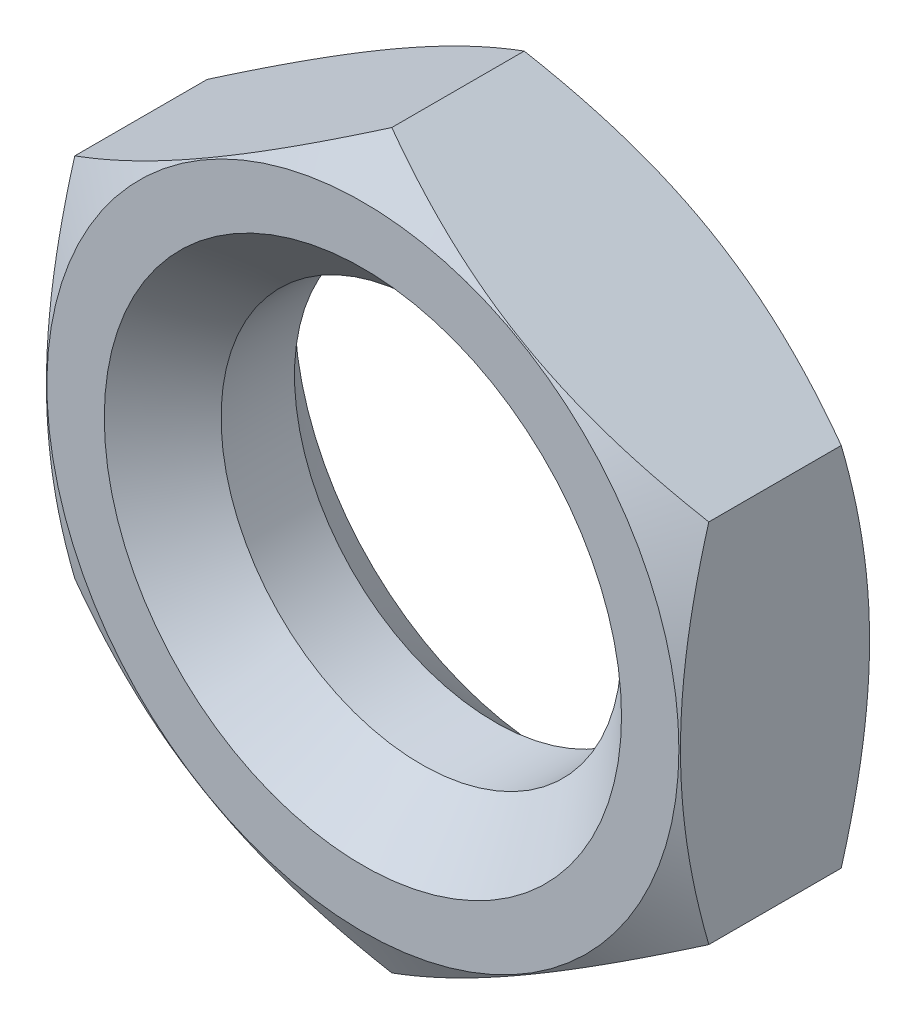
from build123d import *

# Parameters (mm, degrees)
BOSS_EXTRUDE1_DEPTH = 2.85
SKETCH6_R           = 6
CUT_EXTRUDE1_DEPTH  = 5.7
CHAMFER1_SIZE       = 1.75


with BuildPart() as part:
    # Sketch3 → Boss-Extrude1 (new, symmetric)
    with BuildSketch(Plane.XY):
        Polygon((0, 10.969655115), (-9.5, 5.484827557), (-9.5, -5.484827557), (0, -10.969655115), (9.5, -5.484827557), (9.5, 5.484827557), align=None)
    extrude(amount=BOSS_EXTRUDE1_DEPTH, both=True)

    # Sketch5 → Cut-Revolve1 (revolve, cut)
    with BuildSketch(Plane(origin=(0, 0, 0), x_dir=(0, 0, -1), z_dir=(1, 0, 0)), mode=Mode.PRIVATE) as cut_revolve1_sk:
        Polygon((-2.85, 10.969655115), (-2.85, 9.469655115), (-1.983974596, 10.969655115), align=None)
    cut_revolve1 = revolve(cut_revolve1_sk.sketch.rotate(Axis((0, 0, 5.457798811), (0, 0, -1)), 300.000000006), axis=Axis((0, 0, 5.457798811), (0, 0, -1)), mode=Mode.SUBTRACT)

    # Mirror1: Cut-Revolve1 across plane
    add(cut_revolve1.mirror(Plane.XY), mode=Mode.SUBTRACT)

    # Sketch6 → Cut-Extrude1 (cut)
    with BuildSketch(Plane.XY.offset(2.85)):
        Circle(SKETCH6_R)
    extrude(amount=-CUT_EXTRUDE1_DEPTH, mode=Mode.SUBTRACT)

    # Chamfer1
    chamfer1_edges = [part.edges().sort_by_distance(p)[0] for p in [
        (-6, 0, -2.85),
        (-6, 0, 2.85),
    ]]
    chamfer(chamfer1_edges, length=CHAMFER1_SIZE)


solid = part.part
